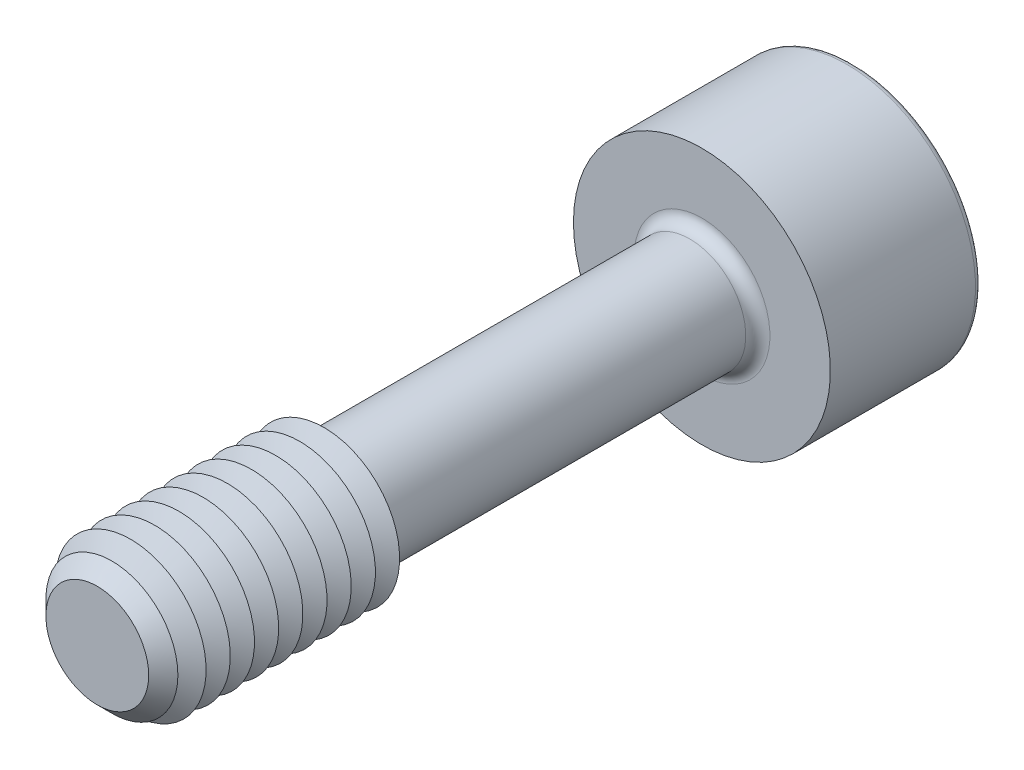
ISO-10303-21;
HEADER;
FILE_DESCRIPTION(('STEP AP214'),'2;1');
FILE_NAME('part.step','',(''),(''),'','','');
FILE_SCHEMA(('AUTOMOTIVE_DESIGN { 1 0 10303 214 1 1 1 1 }'));
ENDSEC;
DATA;
#1=APPLICATION_CONTEXT('core data for automotive mechanical design processes');
#2=APPLICATION_PROTOCOL_DEFINITION('international standard','automotive_design',2000,#1);
#3=PRODUCT_CONTEXT('',#1,'mechanical');
#4=PRODUCT('Part','Part','',(#3));
#5=PRODUCT_RELATED_PRODUCT_CATEGORY('part','',(#4));
#6=PRODUCT_DEFINITION_FORMATION('','',#4);
#7=PRODUCT_DEFINITION_CONTEXT('part definition',#1,'design');
#8=PRODUCT_DEFINITION('design','',#6,#7);
#9=PRODUCT_DEFINITION_SHAPE('','',#8);
#10=(LENGTH_UNIT() NAMED_UNIT(*) SI_UNIT(.MILLI.,.METRE.));
#11=(NAMED_UNIT(*) PLANE_ANGLE_UNIT() SI_UNIT($,.RADIAN.));
#12=(NAMED_UNIT(*) SI_UNIT($,.STERADIAN.) SOLID_ANGLE_UNIT());
#13=UNCERTAINTY_MEASURE_WITH_UNIT(LENGTH_MEASURE(1.E-05),#10,'distance_accuracy_value','');
#14=(GEOMETRIC_REPRESENTATION_CONTEXT(3) GLOBAL_UNCERTAINTY_ASSIGNED_CONTEXT((#13)) GLOBAL_UNIT_ASSIGNED_CONTEXT((#10,
#11,#12)) REPRESENTATION_CONTEXT('',''));
#15=CARTESIAN_POINT('',(0.,0.,0.));
#16=DIRECTION('',(0.,0.,1.));
#17=DIRECTION('',(1.,0.,0.));
#18=AXIS2_PLACEMENT_3D('',#15,#16,#17);
#19=CARTESIAN_POINT('',(-1.15470053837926,-2.,-11.));
#20=DIRECTION('',(0.,0.,1.));
#21=DIRECTION('',(1.,0.,0.));
#22=AXIS2_PLACEMENT_3D('',#19,#20,#21);
#23=PLANE('',#22);
#24=DIRECTION('',(1.,0.,0.));
#25=VECTOR('',#24,1.);
#26=CARTESIAN_POINT('',(-1.15470053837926,-2.,-11.));
#27=LINE('',#26,#25);
#28=CARTESIAN_POINT('',(0.,-2.,-11.));
#29=VERTEX_POINT('',#28);
#30=CARTESIAN_POINT('',(1.15470053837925,-2.,-11.));
#31=VERTEX_POINT('',#30);
#32=EDGE_CURVE('E795',#29,#31,#27,.T.);
#33=ORIENTED_EDGE('',*,*,#32,.F.);
#34=CARTESIAN_POINT('',(0.,0.,-11.));
#35=DIRECTION('',(0.,0.,1.));
#36=DIRECTION('',(0.,-1.,0.));
#37=AXIS2_PLACEMENT_3D('',#34,#35,#36);
#38=CIRCLE('',#37,2.);
#39=CARTESIAN_POINT('',(1.73205080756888,-0.999999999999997,-11.));
#40=VERTEX_POINT('',#39);
#41=EDGE_CURVE('E52',#29,#40,#38,.T.);
#42=ORIENTED_EDGE('',*,*,#41,.T.);
#43=DIRECTION('',(0.5,0.866025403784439,0.));
#44=VECTOR('',#43,1.);
#45=CARTESIAN_POINT('',(1.15470053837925,-2.,-11.));
#46=LINE('',#45,#44);
#47=EDGE_CURVE('E780',#31,#40,#46,.T.);
#48=ORIENTED_EDGE('',*,*,#47,.F.);
#49=EDGE_LOOP('',(#33,#42,#48));
#50=FACE_BOUND('',#49,.T.);
#51=ADVANCED_FACE('F40',(#50),#23,.F.);
#52=CARTESIAN_POINT('',(2.3094010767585,0.,-11.));
#53=VERTEX_POINT('',#52);
#54=EDGE_CURVE('E791',#40,#53,#46,.T.);
#55=ORIENTED_EDGE('',*,*,#54,.F.);
#56=CARTESIAN_POINT('',(1.73205080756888,1.,-11.));
#57=VERTEX_POINT('',#56);
#58=EDGE_CURVE('E11',#40,#57,#38,.T.);
#59=ORIENTED_EDGE('',*,*,#58,.T.);
#60=DIRECTION('',(-0.499999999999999,0.866025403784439,0.));
#61=VECTOR('',#60,1.);
#62=CARTESIAN_POINT('',(2.3094010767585,0.,-11.));
#63=LINE('',#62,#61);
#64=EDGE_CURVE('E779',#53,#57,#63,.T.);
#65=ORIENTED_EDGE('',*,*,#64,.F.);
#66=EDGE_LOOP('',(#55,#59,#65));
#67=FACE_BOUND('',#66,.T.);
#68=ADVANCED_FACE('F132',(#67),#23,.F.);
#69=CARTESIAN_POINT('',(1.15470053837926,2.,-11.));
#70=VERTEX_POINT('',#69);
#71=EDGE_CURVE('E775',#57,#70,#63,.T.);
#72=ORIENTED_EDGE('',*,*,#71,.F.);
#73=CARTESIAN_POINT('',(0.,2.00000000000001,-11.));
#74=VERTEX_POINT('',#73);
#75=EDGE_CURVE('E50',#57,#74,#38,.T.);
#76=ORIENTED_EDGE('',*,*,#75,.T.);
#77=DIRECTION('',(-1.,0.,0.));
#78=VECTOR('',#77,1.);
#79=CARTESIAN_POINT('',(1.15470053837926,2.,-11.));
#80=LINE('',#79,#78);
#81=EDGE_CURVE('E176',#70,#74,#80,.T.);
#82=ORIENTED_EDGE('',*,*,#81,.F.);
#83=EDGE_LOOP('',(#72,#76,#82));
#84=FACE_BOUND('',#83,.T.);
#85=ADVANCED_FACE('F138',(#84),#23,.F.);
#86=CARTESIAN_POINT('',(-1.15470053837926,2.,-11.));
#87=VERTEX_POINT('',#86);
#88=EDGE_CURVE('E785',#74,#87,#80,.T.);
#89=ORIENTED_EDGE('',*,*,#88,.F.);
#90=CARTESIAN_POINT('',(-1.73205080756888,1.00000000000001,-11.));
#91=VERTEX_POINT('',#90);
#92=EDGE_CURVE('E262',#74,#91,#38,.T.);
#93=ORIENTED_EDGE('',*,*,#92,.T.);
#94=DIRECTION('',(-0.5,-0.866025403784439,0.));
#95=VECTOR('',#94,1.);
#96=CARTESIAN_POINT('',(-1.15470053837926,2.,-11.));
#97=LINE('',#96,#95);
#98=EDGE_CURVE('E175',#87,#91,#97,.T.);
#99=ORIENTED_EDGE('',*,*,#98,.F.);
#100=EDGE_LOOP('',(#89,#93,#99));
#101=FACE_BOUND('',#100,.T.);
#102=ADVANCED_FACE('F156',(#101),#23,.F.);
#103=CARTESIAN_POINT('',(-2.30940107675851,0.,-11.));
#104=VERTEX_POINT('',#103);
#105=EDGE_CURVE('E169',#91,#104,#97,.T.);
#106=ORIENTED_EDGE('',*,*,#105,.F.);
#107=CARTESIAN_POINT('',(-1.73205080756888,-0.999999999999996,-11.));
#108=VERTEX_POINT('',#107);
#109=EDGE_CURVE('E171',#91,#108,#38,.T.);
#110=ORIENTED_EDGE('',*,*,#109,.T.);
#111=DIRECTION('',(0.5,-0.866025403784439,0.));
#112=VECTOR('',#111,1.);
#113=CARTESIAN_POINT('',(-2.30940107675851,0.,-11.));
#114=LINE('',#113,#112);
#115=EDGE_CURVE('E173',#104,#108,#114,.T.);
#116=ORIENTED_EDGE('',*,*,#115,.F.);
#117=EDGE_LOOP('',(#106,#110,#116));
#118=FACE_BOUND('',#117,.T.);
#119=ADVANCED_FACE('F145',(#118),#23,.F.);
#120=CARTESIAN_POINT('',(0.,0.,-15.));
#121=DIRECTION('',(0.,0.,-1.));
#122=DIRECTION('',(-1.,0.,0.));
#123=AXIS2_PLACEMENT_3D('',#120,#121,#122);
#124=PLANE('',#123);
#125=CARTESIAN_POINT('',(0.,0.,-15.));
#126=DIRECTION('',(0.,0.,-1.));
#127=DIRECTION('',(-1.,0.,0.));
#128=AXIS2_PLACEMENT_3D('',#125,#126,#127);
#129=CIRCLE('',#128,4.05);
#130=CARTESIAN_POINT('',(-4.05,0.,-15.));
#131=VERTEX_POINT('',#130);
#132=EDGE_CURVE('E249',#131,#131,#129,.T.);
#133=ORIENTED_EDGE('',*,*,#132,.T.);
#134=EDGE_LOOP('',(#133));
#135=FACE_BOUND('',#134,.T.);
#136=DIRECTION('',(-0.5,-0.866025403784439,0.));
#137=VECTOR('',#136,1.);
#138=CARTESIAN_POINT('',(-1.15470053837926,2.,-15.));
#139=LINE('',#138,#137);
#140=CARTESIAN_POINT('',(-1.15470053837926,2.,-15.));
#141=VERTEX_POINT('',#140);
#142=CARTESIAN_POINT('',(-2.30940107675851,0.,-15.));
#143=VERTEX_POINT('',#142);
#144=EDGE_CURVE('E210',#141,#143,#139,.T.);
#145=ORIENTED_EDGE('',*,*,#144,.T.);
#146=DIRECTION('',(0.5,-0.866025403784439,0.));
#147=VECTOR('',#146,1.);
#148=CARTESIAN_POINT('',(-2.30940107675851,0.,-15.));
#149=LINE('',#148,#147);
#150=CARTESIAN_POINT('',(-1.15470053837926,-2.,-15.));
#151=VERTEX_POINT('',#150);
#152=EDGE_CURVE('E66',#143,#151,#149,.T.);
#153=ORIENTED_EDGE('',*,*,#152,.T.);
#154=DIRECTION('',(1.,0.,0.));
#155=VECTOR('',#154,1.);
#156=CARTESIAN_POINT('',(-1.15470053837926,-2.,-15.));
#157=LINE('',#156,#155);
#158=CARTESIAN_POINT('',(1.15470053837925,-2.,-15.));
#159=VERTEX_POINT('',#158);
#160=EDGE_CURVE('E195',#151,#159,#157,.T.);
#161=ORIENTED_EDGE('',*,*,#160,.T.);
#162=DIRECTION('',(0.5,0.866025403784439,0.));
#163=VECTOR('',#162,1.);
#164=CARTESIAN_POINT('',(1.15470053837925,-2.,-15.));
#165=LINE('',#164,#163);
#166=CARTESIAN_POINT('',(2.3094010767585,0.,-15.));
#167=VERTEX_POINT('',#166);
#168=EDGE_CURVE('E199',#159,#167,#165,.T.);
#169=ORIENTED_EDGE('',*,*,#168,.T.);
#170=DIRECTION('',(-0.499999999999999,0.866025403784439,0.));
#171=VECTOR('',#170,1.);
#172=CARTESIAN_POINT('',(2.3094010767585,0.,-15.));
#173=LINE('',#172,#171);
#174=CARTESIAN_POINT('',(1.15470053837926,2.,-15.));
#175=VERTEX_POINT('',#174);
#176=EDGE_CURVE('E203',#167,#175,#173,.T.);
#177=ORIENTED_EDGE('',*,*,#176,.T.);
#178=DIRECTION('',(-1.,0.,0.));
#179=VECTOR('',#178,1.);
#180=CARTESIAN_POINT('',(1.15470053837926,2.,-15.));
#181=LINE('',#180,#179);
#182=EDGE_CURVE('E207',#175,#141,#181,.T.);
#183=ORIENTED_EDGE('',*,*,#182,.T.);
#184=EDGE_LOOP('',(#145,#153,#161,#169,#177,#183));
#185=FACE_BOUND('',#184,.T.);
#186=ADVANCED_FACE('F155',(#135,#185),#124,.T.);
#187=CARTESIAN_POINT('',(0.,0.,10.));
#188=DIRECTION('',(0.,0.,-1.));
#189=DIRECTION('',(-1.,0.,0.));
#190=AXIS2_PLACEMENT_3D('',#187,#188,#189);
#191=CYLINDRICAL_SURFACE('',#190,1.85);
#192=CARTESIAN_POINT('',(0.,0.,-9.6));
#193=DIRECTION('',(0.,0.,-1.));
#194=DIRECTION('',(-1.,0.,0.));
#195=AXIS2_PLACEMENT_3D('',#192,#193,#194);
#196=CIRCLE('',#195,1.85);
#197=CARTESIAN_POINT('',(-1.85,0.,-9.6));
#198=VERTEX_POINT('',#197);
#199=EDGE_CURVE('E245',#198,#198,#196,.F.);
#200=ORIENTED_EDGE('',*,*,#199,.T.);
#201=EDGE_LOOP('',(#200));
#202=FACE_BOUND('',#201,.T.);
#203=CARTESIAN_POINT('',(0.,0.,2.12472232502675));
#204=DIRECTION('',(0.,0.,-1.));
#205=DIRECTION('',(0.,1.,0.));
#206=AXIS2_PLACEMENT_3D('',#203,#204,#205);
#207=CIRCLE('',#206,1.85);
#208=CARTESIAN_POINT('',(0.,1.85,2.12472232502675));
#209=VERTEX_POINT('',#208);
#210=EDGE_CURVE('E233',#209,#209,#207,.T.);
#211=ORIENTED_EDGE('',*,*,#210,.T.);
#212=EDGE_LOOP('',(#211));
#213=FACE_BOUND('',#212,.T.);
#214=ADVANCED_FACE('F162',(#202,#213),#191,.T.);
#215=CARTESIAN_POINT('',(0.,0.,2.12472232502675));
#216=DIRECTION('',(0.,0.,1.));
#217=DIRECTION('',(0.,-1.,0.));
#218=AXIS2_PLACEMENT_3D('',#215,#216,#217);
#219=CONICAL_SURFACE('',#218,1.85,1.0471975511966);
#220=CARTESIAN_POINT('',(0.,0.,2.5));
#221=DIRECTION('',(0.,0.,-1.));
#222=DIRECTION('',(-1.,0.,0.));
#223=AXIS2_PLACEMENT_3D('',#220,#221,#222);
#224=CIRCLE('',#223,2.5);
#225=CARTESIAN_POINT('',(-2.5,0.,2.5));
#226=VERTEX_POINT('',#225);
#227=EDGE_CURVE('E266',#226,#226,#224,.T.);
#228=ORIENTED_EDGE('',*,*,#227,.T.);
#229=EDGE_LOOP('',(#228));
#230=FACE_BOUND('',#229,.T.);
#231=ORIENTED_EDGE('',*,*,#210,.F.);
#232=EDGE_LOOP('',(#231));
#233=FACE_BOUND('',#232,.T.);
#234=ADVANCED_FACE('F536',(#230,#233),#219,.T.);
#235=CARTESIAN_POINT('',(0.,0.,-10.));
#236=DIRECTION('',(0.,0.,-1.));
#237=DIRECTION('',(-1.,0.,0.));
#238=AXIS2_PLACEMENT_3D('',#235,#236,#237);
#239=PLANE('',#238);
#240=CARTESIAN_POINT('',(0.,0.,-10.));
#241=DIRECTION('',(0.,0.,-1.));
#242=DIRECTION('',(-1.,0.,0.));
#243=AXIS2_PLACEMENT_3D('',#240,#241,#242);
#244=CIRCLE('',#243,2.25);
#245=CARTESIAN_POINT('',(-2.25,0.,-10.));
#246=VERTEX_POINT('',#245);
#247=EDGE_CURVE('E241',#246,#246,#244,.T.);
#248=ORIENTED_EDGE('',*,*,#247,.T.);
#249=EDGE_LOOP('',(#248));
#250=FACE_BOUND('',#249,.T.);
#251=CARTESIAN_POINT('',(0.,0.,-10.));
#252=DIRECTION('',(0.,0.,-1.));
#253=DIRECTION('',(-1.,0.,0.));
#254=AXIS2_PLACEMENT_3D('',#251,#252,#253);
#255=CIRCLE('',#254,4.25);
#256=CARTESIAN_POINT('',(-4.25,0.,-10.));
#257=VERTEX_POINT('',#256);
#258=EDGE_CURVE('E229',#257,#257,#255,.T.);
#259=ORIENTED_EDGE('',*,*,#258,.F.);
#260=EDGE_LOOP('',(#259));
#261=FACE_BOUND('',#260,.T.);
#262=ADVANCED_FACE('F529',(#250,#261),#239,.F.);
#263=CARTESIAN_POINT('',(0.,0.,-15.));
#264=DIRECTION('',(0.,0.,1.));
#265=DIRECTION('',(1.,0.,0.));
#266=AXIS2_PLACEMENT_3D('',#263,#264,#265);
#267=CYLINDRICAL_SURFACE('',#266,4.25);
#268=CARTESIAN_POINT('',(0.,0.,-14.8));
#269=DIRECTION('',(0.,0.,-1.));
#270=DIRECTION('',(-1.,0.,0.));
#271=AXIS2_PLACEMENT_3D('',#268,#269,#270);
#272=CIRCLE('',#271,4.25);
#273=CARTESIAN_POINT('',(-4.25,0.,-14.8));
#274=VERTEX_POINT('',#273);
#275=EDGE_CURVE('E252',#274,#274,#272,.F.);
#276=ORIENTED_EDGE('',*,*,#275,.T.);
#277=EDGE_LOOP('',(#276));
#278=FACE_BOUND('',#277,.T.);
#279=ORIENTED_EDGE('',*,*,#258,.T.);
#280=EDGE_LOOP('',(#279));
#281=FACE_BOUND('',#280,.T.);
#282=ADVANCED_FACE('F535',(#278,#281),#267,.T.);
#283=CARTESIAN_POINT('',(-2.30940107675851,0.,-11.));
#284=DIRECTION('',(0.866025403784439,0.5,0.));
#285=DIRECTION('',(-0.5,0.866025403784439,0.));
#286=AXIS2_PLACEMENT_3D('',#283,#284,#285);
#287=PLANE('',#286);
#288=ORIENTED_EDGE('',*,*,#152,.F.);
#289=DIRECTION('',(0.,0.,-1.));
#290=VECTOR('',#289,1.);
#291=CARTESIAN_POINT('',(-2.30940107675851,0.,-11.));
#292=LINE('',#291,#290);
#293=EDGE_CURVE('E185',#104,#143,#292,.T.);
#294=ORIENTED_EDGE('',*,*,#293,.F.);
#295=ORIENTED_EDGE('',*,*,#115,.T.);
#296=CARTESIAN_POINT('',(-1.15470053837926,-2.,-11.));
#297=VERTEX_POINT('',#296);
#298=EDGE_CURVE('E213',#108,#297,#114,.T.);
#299=ORIENTED_EDGE('',*,*,#298,.T.);
#300=DIRECTION('',(0.,0.,-1.));
#301=VECTOR('',#300,1.);
#302=CARTESIAN_POINT('',(-1.15470053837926,-2.,-11.));
#303=LINE('',#302,#301);
#304=EDGE_CURVE('E226',#297,#151,#303,.T.);
#305=ORIENTED_EDGE('',*,*,#304,.T.);
#306=EDGE_LOOP('',(#288,#294,#295,#299,#305));
#307=FACE_BOUND('',#306,.T.);
#308=ADVANCED_FACE('F547',(#307),#287,.T.);
#309=CARTESIAN_POINT('',(-1.15470053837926,-2.,-11.));
#310=DIRECTION('',(0.,1.,0.));
#311=DIRECTION('',(-1.,0.,0.));
#312=AXIS2_PLACEMENT_3D('',#309,#310,#311);
#313=PLANE('',#312);
#314=ORIENTED_EDGE('',*,*,#160,.F.);
#315=ORIENTED_EDGE('',*,*,#304,.F.);
#316=EDGE_CURVE('E792',#297,#29,#27,.T.);
#317=ORIENTED_EDGE('',*,*,#316,.T.);
#318=ORIENTED_EDGE('',*,*,#32,.T.);
#319=DIRECTION('',(0.,0.,-1.));
#320=VECTOR('',#319,1.);
#321=CARTESIAN_POINT('',(1.15470053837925,-2.,-11.));
#322=LINE('',#321,#320);
#323=EDGE_CURVE('E223',#31,#159,#322,.T.);
#324=ORIENTED_EDGE('',*,*,#323,.T.);
#325=EDGE_LOOP('',(#314,#315,#317,#318,#324));
#326=FACE_BOUND('',#325,.T.);
#327=ADVANCED_FACE('F563',(#326),#313,.T.);
#328=CARTESIAN_POINT('',(1.15470053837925,-2.,-11.));
#329=DIRECTION('',(-0.866025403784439,0.5,0.));
#330=DIRECTION('',(-0.5,-0.866025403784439,0.));
#331=AXIS2_PLACEMENT_3D('',#328,#329,#330);
#332=PLANE('',#331);
#333=ORIENTED_EDGE('',*,*,#168,.F.);
#334=ORIENTED_EDGE('',*,*,#323,.F.);
#335=ORIENTED_EDGE('',*,*,#47,.T.);
#336=ORIENTED_EDGE('',*,*,#54,.T.);
#337=DIRECTION('',(0.,0.,-1.));
#338=VECTOR('',#337,1.);
#339=CARTESIAN_POINT('',(2.3094010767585,0.,-11.));
#340=LINE('',#339,#338);
#341=EDGE_CURVE('E220',#53,#167,#340,.T.);
#342=ORIENTED_EDGE('',*,*,#341,.T.);
#343=EDGE_LOOP('',(#333,#334,#335,#336,#342));
#344=FACE_BOUND('',#343,.T.);
#345=ADVANCED_FACE('F573',(#344),#332,.T.);
#346=CARTESIAN_POINT('',(2.3094010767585,0.,-11.));
#347=DIRECTION('',(-0.866025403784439,-0.499999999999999,0.));
#348=DIRECTION('',(0.499999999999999,-0.866025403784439,0.));
#349=AXIS2_PLACEMENT_3D('',#346,#347,#348);
#350=PLANE('',#349);
#351=ORIENTED_EDGE('',*,*,#176,.F.);
#352=ORIENTED_EDGE('',*,*,#341,.F.);
#353=ORIENTED_EDGE('',*,*,#64,.T.);
#354=ORIENTED_EDGE('',*,*,#71,.T.);
#355=DIRECTION('',(0.,0.,-1.));
#356=VECTOR('',#355,1.);
#357=CARTESIAN_POINT('',(1.15470053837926,2.,-11.));
#358=LINE('',#357,#356);
#359=EDGE_CURVE('E217',#70,#175,#358,.T.);
#360=ORIENTED_EDGE('',*,*,#359,.T.);
#361=EDGE_LOOP('',(#351,#352,#353,#354,#360));
#362=FACE_BOUND('',#361,.T.);
#363=ADVANCED_FACE('F583',(#362),#350,.T.);
#364=CARTESIAN_POINT('',(1.15470053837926,2.,-11.));
#365=DIRECTION('',(0.,-1.,0.));
#366=DIRECTION('',(0.,0.,-1.));
#367=AXIS2_PLACEMENT_3D('',#364,#365,#366);
#368=PLANE('',#367);
#369=ORIENTED_EDGE('',*,*,#182,.F.);
#370=ORIENTED_EDGE('',*,*,#359,.F.);
#371=ORIENTED_EDGE('',*,*,#81,.T.);
#372=ORIENTED_EDGE('',*,*,#88,.T.);
#373=DIRECTION('',(0.,0.,-1.));
#374=VECTOR('',#373,1.);
#375=CARTESIAN_POINT('',(-1.15470053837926,2.,-11.));
#376=LINE('',#375,#374);
#377=EDGE_CURVE('E181',#87,#141,#376,.T.);
#378=ORIENTED_EDGE('',*,*,#377,.T.);
#379=EDGE_LOOP('',(#369,#370,#371,#372,#378));
#380=FACE_BOUND('',#379,.T.);
#381=ADVANCED_FACE('F151',(#380),#368,.T.);
#382=CARTESIAN_POINT('',(-1.15470053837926,2.,-11.));
#383=DIRECTION('',(0.866025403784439,-0.5,0.));
#384=DIRECTION('',(0.5,0.866025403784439,0.));
#385=AXIS2_PLACEMENT_3D('',#382,#383,#384);
#386=PLANE('',#385);
#387=ORIENTED_EDGE('',*,*,#144,.F.);
#388=ORIENTED_EDGE('',*,*,#377,.F.);
#389=ORIENTED_EDGE('',*,*,#98,.T.);
#390=ORIENTED_EDGE('',*,*,#105,.T.);
#391=ORIENTED_EDGE('',*,*,#293,.T.);
#392=EDGE_LOOP('',(#387,#388,#389,#390,#391));
#393=FACE_BOUND('',#392,.T.);
#394=ADVANCED_FACE('F143',(#393),#386,.T.);
#395=ORIENTED_EDGE('',*,*,#298,.F.);
#396=EDGE_CURVE('E255',#108,#29,#38,.T.);
#397=ORIENTED_EDGE('',*,*,#396,.T.);
#398=ORIENTED_EDGE('',*,*,#316,.F.);
#399=EDGE_LOOP('',(#395,#397,#398));
#400=FACE_BOUND('',#399,.T.);
#401=ADVANCED_FACE('F134',(#400),#23,.F.);
#402=CARTESIAN_POINT('',(0.,0.,-9.6));
#403=DIRECTION('',(0.,0.,-1.));
#404=DIRECTION('',(-1.,0.,0.));
#405=AXIS2_PLACEMENT_3D('',#402,#403,#404);
#406=TOROIDAL_SURFACE('',#405,2.25,0.4);
#407=ORIENTED_EDGE('',*,*,#199,.F.);
#408=EDGE_LOOP('',(#407));
#409=FACE_BOUND('',#408,.T.);
#410=ORIENTED_EDGE('',*,*,#247,.F.);
#411=EDGE_LOOP('',(#410));
#412=FACE_BOUND('',#411,.T.);
#413=ADVANCED_FACE('F128',(#409,#412),#406,.F.);
#414=CARTESIAN_POINT('',(0.,0.,-14.8));
#415=DIRECTION('',(0.,0.,-1.));
#416=DIRECTION('',(-1.,0.,0.));
#417=AXIS2_PLACEMENT_3D('',#414,#415,#416);
#418=TOROIDAL_SURFACE('',#417,4.05,0.2);
#419=ORIENTED_EDGE('',*,*,#275,.F.);
#420=EDGE_LOOP('',(#419));
#421=FACE_BOUND('',#420,.T.);
#422=ORIENTED_EDGE('',*,*,#132,.F.);
#423=EDGE_LOOP('',(#422));
#424=FACE_BOUND('',#423,.T.);
#425=ADVANCED_FACE('F42',(#421,#424),#418,.T.);
#426=CARTESIAN_POINT('',(0.,0.,-9.84529946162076));
#427=DIRECTION('',(0.,0.,-1.));
#428=DIRECTION('',(0.,1.,0.));
#429=AXIS2_PLACEMENT_3D('',#426,#427,#428);
#430=CONICAL_SURFACE('',#429,0.,1.04719755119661);
#431=ORIENTED_EDGE('',*,*,#41,.F.);
#432=ORIENTED_EDGE('',*,*,#396,.F.);
#433=ORIENTED_EDGE('',*,*,#109,.F.);
#434=ORIENTED_EDGE('',*,*,#92,.F.);
#435=ORIENTED_EDGE('',*,*,#75,.F.);
#436=ORIENTED_EDGE('',*,*,#58,.F.);
#437=EDGE_LOOP('',(#431,#432,#433,#434,#435,#436));
#438=FACE_BOUND('',#437,.T.);
#439=CARTESIAN_POINT('',(0.,0.,-9.84529946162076));
#440=VERTEX_POINT('',#439);
#441=VERTEX_LOOP('',#440);
#442=FACE_BOUND('',#441,.T.);
#443=ADVANCED_FACE('F117',(#438,#442),#430,.F.);
#444=CARTESIAN_POINT('',(0.,0.,2.9));
#445=DIRECTION('',(0.,0.,-1.));
#446=DIRECTION('',(-1.,0.,0.));
#447=AXIS2_PLACEMENT_3D('',#444,#445,#446);
#448=CONICAL_SURFACE('',#447,1.80717967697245,1.0471975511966);
#449=ORIENTED_EDGE('',*,*,#227,.F.);
#450=EDGE_LOOP('',(#449));
#451=FACE_BOUND('',#450,.T.);
#452=CARTESIAN_POINT('',(0.,0.,2.9));
#453=DIRECTION('',(0.,0.,-1.));
#454=DIRECTION('',(-1.,0.,0.));
#455=AXIS2_PLACEMENT_3D('',#452,#453,#454);
#456=CIRCLE('',#455,1.80717967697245);
#457=CARTESIAN_POINT('',(-1.80717967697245,0.,2.9));
#458=VERTEX_POINT('',#457);
#459=EDGE_CURVE('E273',#458,#458,#456,.T.);
#460=ORIENTED_EDGE('',*,*,#459,.T.);
#461=EDGE_LOOP('',(#460));
#462=FACE_BOUND('',#461,.T.);
#463=ADVANCED_FACE('F119',(#451,#462),#448,.T.);
#464=CARTESIAN_POINT('',(0.,0.,3.3));
#465=DIRECTION('',(0.,0.,1.));
#466=DIRECTION('',(1.,0.,0.));
#467=AXIS2_PLACEMENT_3D('',#464,#465,#466);
#468=CONICAL_SURFACE('',#467,2.5,1.0471975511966);
#469=ORIENTED_EDGE('',*,*,#459,.F.);
#470=EDGE_LOOP('',(#469));
#471=FACE_BOUND('',#470,.T.);
#472=CARTESIAN_POINT('',(0.,0.,3.3));
#473=DIRECTION('',(0.,0.,-1.));
#474=DIRECTION('',(-1.,0.,0.));
#475=AXIS2_PLACEMENT_3D('',#472,#473,#474);
#476=CIRCLE('',#475,2.5);
#477=CARTESIAN_POINT('',(-2.5,0.,3.3));
#478=VERTEX_POINT('',#477);
#479=EDGE_CURVE('E279',#478,#478,#476,.T.);
#480=ORIENTED_EDGE('',*,*,#479,.T.);
#481=EDGE_LOOP('',(#480));
#482=FACE_BOUND('',#481,.T.);
#483=ADVANCED_FACE('F125',(#471,#482),#468,.T.);
#484=CARTESIAN_POINT('',(0.,0.,3.7));
#485=DIRECTION('',(0.,0.,-1.));
#486=DIRECTION('',(-1.,0.,0.));
#487=AXIS2_PLACEMENT_3D('',#484,#485,#486);
#488=CONICAL_SURFACE('',#487,1.80717967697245,1.0471975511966);
#489=ORIENTED_EDGE('',*,*,#479,.F.);
#490=EDGE_LOOP('',(#489));
#491=FACE_BOUND('',#490,.T.);
#492=CARTESIAN_POINT('',(0.,0.,3.7));
#493=DIRECTION('',(0.,0.,-1.));
#494=DIRECTION('',(-1.,0.,0.));
#495=AXIS2_PLACEMENT_3D('',#492,#493,#494);
#496=CIRCLE('',#495,1.80717967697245);
#497=CARTESIAN_POINT('',(-1.80717967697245,0.,3.7));
#498=VERTEX_POINT('',#497);
#499=EDGE_CURVE('E285',#498,#498,#496,.T.);
#500=ORIENTED_EDGE('',*,*,#499,.T.);
#501=EDGE_LOOP('',(#500));
#502=FACE_BOUND('',#501,.T.);
#503=ADVANCED_FACE('F413',(#491,#502),#488,.T.);
#504=CARTESIAN_POINT('',(0.,0.,4.1));
#505=DIRECTION('',(0.,0.,1.));
#506=DIRECTION('',(1.,0.,0.));
#507=AXIS2_PLACEMENT_3D('',#504,#505,#506);
#508=CONICAL_SURFACE('',#507,2.5,1.0471975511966);
#509=ORIENTED_EDGE('',*,*,#499,.F.);
#510=EDGE_LOOP('',(#509));
#511=FACE_BOUND('',#510,.T.);
#512=CARTESIAN_POINT('',(0.,0.,4.1));
#513=DIRECTION('',(0.,0.,-1.));
#514=DIRECTION('',(-1.,0.,0.));
#515=AXIS2_PLACEMENT_3D('',#512,#513,#514);
#516=CIRCLE('',#515,2.5);
#517=CARTESIAN_POINT('',(-2.5,0.,4.1));
#518=VERTEX_POINT('',#517);
#519=EDGE_CURVE('E289',#518,#518,#516,.T.);
#520=ORIENTED_EDGE('',*,*,#519,.T.);
#521=EDGE_LOOP('',(#520));
#522=FACE_BOUND('',#521,.T.);
#523=ADVANCED_FACE('F409',(#511,#522),#508,.T.);
#524=CARTESIAN_POINT('',(0.,0.,4.5));
#525=DIRECTION('',(0.,0.,-1.));
#526=DIRECTION('',(-1.,0.,0.));
#527=AXIS2_PLACEMENT_3D('',#524,#525,#526);
#528=CONICAL_SURFACE('',#527,1.80717967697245,1.0471975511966);
#529=ORIENTED_EDGE('',*,*,#519,.F.);
#530=EDGE_LOOP('',(#529));
#531=FACE_BOUND('',#530,.T.);
#532=CARTESIAN_POINT('',(0.,0.,4.5));
#533=DIRECTION('',(0.,0.,-1.));
#534=DIRECTION('',(-1.,0.,0.));
#535=AXIS2_PLACEMENT_3D('',#532,#533,#534);
#536=CIRCLE('',#535,1.80717967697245);
#537=CARTESIAN_POINT('',(-1.80717967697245,0.,4.5));
#538=VERTEX_POINT('',#537);
#539=EDGE_CURVE('E293',#538,#538,#536,.T.);
#540=ORIENTED_EDGE('',*,*,#539,.T.);
#541=EDGE_LOOP('',(#540));
#542=FACE_BOUND('',#541,.T.);
#543=ADVANCED_FACE('F405',(#531,#542),#528,.T.);
#544=CARTESIAN_POINT('',(0.,0.,4.9));
#545=DIRECTION('',(0.,0.,1.));
#546=DIRECTION('',(1.,0.,0.));
#547=AXIS2_PLACEMENT_3D('',#544,#545,#546);
#548=CONICAL_SURFACE('',#547,2.5,1.0471975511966);
#549=ORIENTED_EDGE('',*,*,#539,.F.);
#550=EDGE_LOOP('',(#549));
#551=FACE_BOUND('',#550,.T.);
#552=CARTESIAN_POINT('',(0.,0.,4.9));
#553=DIRECTION('',(0.,0.,-1.));
#554=DIRECTION('',(-1.,0.,0.));
#555=AXIS2_PLACEMENT_3D('',#552,#553,#554);
#556=CIRCLE('',#555,2.5);
#557=CARTESIAN_POINT('',(-2.5,0.,4.9));
#558=VERTEX_POINT('',#557);
#559=EDGE_CURVE('E297',#558,#558,#556,.T.);
#560=ORIENTED_EDGE('',*,*,#559,.T.);
#561=EDGE_LOOP('',(#560));
#562=FACE_BOUND('',#561,.T.);
#563=ADVANCED_FACE('F401',(#551,#562),#548,.T.);
#564=CARTESIAN_POINT('',(0.,0.,5.3));
#565=DIRECTION('',(0.,0.,-1.));
#566=DIRECTION('',(-1.,0.,0.));
#567=AXIS2_PLACEMENT_3D('',#564,#565,#566);
#568=CONICAL_SURFACE('',#567,1.80717967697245,1.0471975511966);
#569=ORIENTED_EDGE('',*,*,#559,.F.);
#570=EDGE_LOOP('',(#569));
#571=FACE_BOUND('',#570,.T.);
#572=CARTESIAN_POINT('',(0.,0.,5.3));
#573=DIRECTION('',(0.,0.,-1.));
#574=DIRECTION('',(-1.,0.,0.));
#575=AXIS2_PLACEMENT_3D('',#572,#573,#574);
#576=CIRCLE('',#575,1.80717967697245);
#577=CARTESIAN_POINT('',(-1.80717967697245,0.,5.3));
#578=VERTEX_POINT('',#577);
#579=EDGE_CURVE('E301',#578,#578,#576,.T.);
#580=ORIENTED_EDGE('',*,*,#579,.T.);
#581=EDGE_LOOP('',(#580));
#582=FACE_BOUND('',#581,.T.);
#583=ADVANCED_FACE('F397',(#571,#582),#568,.T.);
#584=CARTESIAN_POINT('',(0.,0.,5.7));
#585=DIRECTION('',(0.,0.,1.));
#586=DIRECTION('',(1.,0.,0.));
#587=AXIS2_PLACEMENT_3D('',#584,#585,#586);
#588=CONICAL_SURFACE('',#587,2.5,1.0471975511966);
#589=ORIENTED_EDGE('',*,*,#579,.F.);
#590=EDGE_LOOP('',(#589));
#591=FACE_BOUND('',#590,.T.);
#592=CARTESIAN_POINT('',(0.,0.,5.7));
#593=DIRECTION('',(0.,0.,-1.));
#594=DIRECTION('',(-1.,0.,0.));
#595=AXIS2_PLACEMENT_3D('',#592,#593,#594);
#596=CIRCLE('',#595,2.5);
#597=CARTESIAN_POINT('',(-2.5,0.,5.7));
#598=VERTEX_POINT('',#597);
#599=EDGE_CURVE('E305',#598,#598,#596,.T.);
#600=ORIENTED_EDGE('',*,*,#599,.T.);
#601=EDGE_LOOP('',(#600));
#602=FACE_BOUND('',#601,.T.);
#603=ADVANCED_FACE('F393',(#591,#602),#588,.T.);
#604=CARTESIAN_POINT('',(0.,0.,6.1));
#605=DIRECTION('',(0.,0.,-1.));
#606=DIRECTION('',(-1.,0.,0.));
#607=AXIS2_PLACEMENT_3D('',#604,#605,#606);
#608=CONICAL_SURFACE('',#607,1.80717967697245,1.0471975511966);
#609=ORIENTED_EDGE('',*,*,#599,.F.);
#610=EDGE_LOOP('',(#609));
#611=FACE_BOUND('',#610,.T.);
#612=CARTESIAN_POINT('',(0.,0.,6.1));
#613=DIRECTION('',(0.,0.,-1.));
#614=DIRECTION('',(-1.,0.,0.));
#615=AXIS2_PLACEMENT_3D('',#612,#613,#614);
#616=CIRCLE('',#615,1.80717967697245);
#617=CARTESIAN_POINT('',(-1.80717967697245,0.,6.1));
#618=VERTEX_POINT('',#617);
#619=EDGE_CURVE('E309',#618,#618,#616,.T.);
#620=ORIENTED_EDGE('',*,*,#619,.T.);
#621=EDGE_LOOP('',(#620));
#622=FACE_BOUND('',#621,.T.);
#623=ADVANCED_FACE('F389',(#611,#622),#608,.T.);
#624=CARTESIAN_POINT('',(0.,0.,6.5));
#625=DIRECTION('',(0.,0.,1.));
#626=DIRECTION('',(1.,0.,0.));
#627=AXIS2_PLACEMENT_3D('',#624,#625,#626);
#628=CONICAL_SURFACE('',#627,2.5,1.0471975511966);
#629=ORIENTED_EDGE('',*,*,#619,.F.);
#630=EDGE_LOOP('',(#629));
#631=FACE_BOUND('',#630,.T.);
#632=CARTESIAN_POINT('',(0.,0.,6.5));
#633=DIRECTION('',(0.,0.,-1.));
#634=DIRECTION('',(-1.,0.,0.));
#635=AXIS2_PLACEMENT_3D('',#632,#633,#634);
#636=CIRCLE('',#635,2.5);
#637=CARTESIAN_POINT('',(-2.5,0.,6.5));
#638=VERTEX_POINT('',#637);
#639=EDGE_CURVE('E312',#638,#638,#636,.T.);
#640=ORIENTED_EDGE('',*,*,#639,.T.);
#641=EDGE_LOOP('',(#640));
#642=FACE_BOUND('',#641,.T.);
#643=ADVANCED_FACE('F385',(#631,#642),#628,.T.);
#644=CARTESIAN_POINT('',(0.,0.,6.9));
#645=DIRECTION('',(0.,0.,-1.));
#646=DIRECTION('',(-1.,0.,0.));
#647=AXIS2_PLACEMENT_3D('',#644,#645,#646);
#648=CONICAL_SURFACE('',#647,1.80717967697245,1.0471975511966);
#649=ORIENTED_EDGE('',*,*,#639,.F.);
#650=EDGE_LOOP('',(#649));
#651=FACE_BOUND('',#650,.T.);
#652=CARTESIAN_POINT('',(0.,0.,6.9));
#653=DIRECTION('',(0.,0.,-1.));
#654=DIRECTION('',(-1.,0.,0.));
#655=AXIS2_PLACEMENT_3D('',#652,#653,#654);
#656=CIRCLE('',#655,1.80717967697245);
#657=CARTESIAN_POINT('',(-1.80717967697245,0.,6.9));
#658=VERTEX_POINT('',#657);
#659=EDGE_CURVE('E315',#658,#658,#656,.T.);
#660=ORIENTED_EDGE('',*,*,#659,.T.);
#661=EDGE_LOOP('',(#660));
#662=FACE_BOUND('',#661,.T.);
#663=ADVANCED_FACE('F381',(#651,#662),#648,.T.);
#664=CARTESIAN_POINT('',(0.,0.,7.3));
#665=DIRECTION('',(0.,0.,1.));
#666=DIRECTION('',(1.,0.,0.));
#667=AXIS2_PLACEMENT_3D('',#664,#665,#666);
#668=CONICAL_SURFACE('',#667,2.5,1.0471975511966);
#669=ORIENTED_EDGE('',*,*,#659,.F.);
#670=EDGE_LOOP('',(#669));
#671=FACE_BOUND('',#670,.T.);
#672=CARTESIAN_POINT('',(0.,0.,7.3));
#673=DIRECTION('',(0.,0.,-1.));
#674=DIRECTION('',(-1.,0.,0.));
#675=AXIS2_PLACEMENT_3D('',#672,#673,#674);
#676=CIRCLE('',#675,2.5);
#677=CARTESIAN_POINT('',(-2.5,0.,7.3));
#678=VERTEX_POINT('',#677);
#679=EDGE_CURVE('E319',#678,#678,#676,.T.);
#680=ORIENTED_EDGE('',*,*,#679,.T.);
#681=EDGE_LOOP('',(#680));
#682=FACE_BOUND('',#681,.T.);
#683=ADVANCED_FACE('F377',(#671,#682),#668,.T.);
#684=CARTESIAN_POINT('',(0.,0.,7.7));
#685=DIRECTION('',(0.,0.,-1.));
#686=DIRECTION('',(-1.,0.,0.));
#687=AXIS2_PLACEMENT_3D('',#684,#685,#686);
#688=CONICAL_SURFACE('',#687,1.80717967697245,1.0471975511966);
#689=ORIENTED_EDGE('',*,*,#679,.F.);
#690=EDGE_LOOP('',(#689));
#691=FACE_BOUND('',#690,.T.);
#692=CARTESIAN_POINT('',(0.,0.,7.7));
#693=DIRECTION('',(0.,0.,-1.));
#694=DIRECTION('',(-1.,0.,0.));
#695=AXIS2_PLACEMENT_3D('',#692,#693,#694);
#696=CIRCLE('',#695,1.80717967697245);
#697=CARTESIAN_POINT('',(-1.80717967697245,0.,7.7));
#698=VERTEX_POINT('',#697);
#699=EDGE_CURVE('E323',#698,#698,#696,.T.);
#700=ORIENTED_EDGE('',*,*,#699,.T.);
#701=EDGE_LOOP('',(#700));
#702=FACE_BOUND('',#701,.T.);
#703=ADVANCED_FACE('F373',(#691,#702),#688,.T.);
#704=CARTESIAN_POINT('',(0.,0.,8.1));
#705=DIRECTION('',(0.,0.,1.));
#706=DIRECTION('',(1.,0.,0.));
#707=AXIS2_PLACEMENT_3D('',#704,#705,#706);
#708=CONICAL_SURFACE('',#707,2.5,1.0471975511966);
#709=ORIENTED_EDGE('',*,*,#699,.F.);
#710=EDGE_LOOP('',(#709));
#711=FACE_BOUND('',#710,.T.);
#712=CARTESIAN_POINT('',(0.,0.,8.1));
#713=DIRECTION('',(0.,0.,-1.));
#714=DIRECTION('',(-1.,0.,0.));
#715=AXIS2_PLACEMENT_3D('',#712,#713,#714);
#716=CIRCLE('',#715,2.5);
#717=CARTESIAN_POINT('',(-2.5,0.,8.1));
#718=VERTEX_POINT('',#717);
#719=EDGE_CURVE('E327',#718,#718,#716,.T.);
#720=ORIENTED_EDGE('',*,*,#719,.T.);
#721=EDGE_LOOP('',(#720));
#722=FACE_BOUND('',#721,.T.);
#723=ADVANCED_FACE('F369',(#711,#722),#708,.T.);
#724=CARTESIAN_POINT('',(0.,0.,8.5));
#725=DIRECTION('',(0.,0.,-1.));
#726=DIRECTION('',(-1.,0.,0.));
#727=AXIS2_PLACEMENT_3D('',#724,#725,#726);
#728=CONICAL_SURFACE('',#727,1.80717967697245,1.0471975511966);
#729=ORIENTED_EDGE('',*,*,#719,.F.);
#730=EDGE_LOOP('',(#729));
#731=FACE_BOUND('',#730,.T.);
#732=CARTESIAN_POINT('',(0.,0.,8.5));
#733=DIRECTION('',(0.,0.,-1.));
#734=DIRECTION('',(-1.,0.,0.));
#735=AXIS2_PLACEMENT_3D('',#732,#733,#734);
#736=CIRCLE('',#735,1.80717967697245);
#737=CARTESIAN_POINT('',(-1.80717967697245,0.,8.5));
#738=VERTEX_POINT('',#737);
#739=EDGE_CURVE('E330',#738,#738,#736,.T.);
#740=ORIENTED_EDGE('',*,*,#739,.T.);
#741=EDGE_LOOP('',(#740));
#742=FACE_BOUND('',#741,.T.);
#743=ADVANCED_FACE('F365',(#731,#742),#728,.T.);
#744=CARTESIAN_POINT('',(0.,0.,8.9));
#745=DIRECTION('',(0.,0.,1.));
#746=DIRECTION('',(1.,0.,0.));
#747=AXIS2_PLACEMENT_3D('',#744,#745,#746);
#748=CONICAL_SURFACE('',#747,2.5,1.0471975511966);
#749=ORIENTED_EDGE('',*,*,#739,.F.);
#750=EDGE_LOOP('',(#749));
#751=FACE_BOUND('',#750,.T.);
#752=CARTESIAN_POINT('',(0.,0.,8.9));
#753=DIRECTION('',(0.,0.,-1.));
#754=DIRECTION('',(-1.,0.,0.));
#755=AXIS2_PLACEMENT_3D('',#752,#753,#754);
#756=CIRCLE('',#755,2.5);
#757=CARTESIAN_POINT('',(-2.5,0.,8.9));
#758=VERTEX_POINT('',#757);
#759=EDGE_CURVE('E334',#758,#758,#756,.T.);
#760=ORIENTED_EDGE('',*,*,#759,.T.);
#761=EDGE_LOOP('',(#760));
#762=FACE_BOUND('',#761,.T.);
#763=ADVANCED_FACE('F358',(#751,#762),#748,.T.);
#764=CARTESIAN_POINT('',(0.,0.,9.3));
#765=DIRECTION('',(0.,0.,-1.));
#766=DIRECTION('',(-1.,0.,0.));
#767=AXIS2_PLACEMENT_3D('',#764,#765,#766);
#768=CONICAL_SURFACE('',#767,1.80717967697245,1.0471975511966);
#769=ORIENTED_EDGE('',*,*,#759,.F.);
#770=EDGE_LOOP('',(#769));
#771=FACE_BOUND('',#770,.T.);
#772=CARTESIAN_POINT('',(0.,0.,9.3));
#773=DIRECTION('',(0.,0.,-1.));
#774=DIRECTION('',(-1.,0.,0.));
#775=AXIS2_PLACEMENT_3D('',#772,#773,#774);
#776=CIRCLE('',#775,1.80717967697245);
#777=CARTESIAN_POINT('',(-1.80717967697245,0.,9.3));
#778=VERTEX_POINT('',#777);
#779=EDGE_CURVE('E338',#778,#778,#776,.T.);
#780=ORIENTED_EDGE('',*,*,#779,.T.);
#781=EDGE_LOOP('',(#780));
#782=FACE_BOUND('',#781,.T.);
#783=ADVANCED_FACE('F344',(#771,#782),#768,.T.);
#784=CARTESIAN_POINT('',(0.,0.,9.7));
#785=DIRECTION('',(0.,0.,1.));
#786=DIRECTION('',(1.,0.,0.));
#787=AXIS2_PLACEMENT_3D('',#784,#785,#786);
#788=CONICAL_SURFACE('',#787,2.5,1.0471975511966);
#789=CARTESIAN_POINT('',(0.,0.,9.51698729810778));
#790=DIRECTION('',(0.,0.,1.));
#791=DIRECTION('',(1.,0.,0.));
#792=AXIS2_PLACEMENT_3D('',#789,#790,#791);
#793=CIRCLE('',#792,2.18301270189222);
#794=CARTESIAN_POINT('',(2.18301270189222,0.,9.51698729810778));
#795=VERTEX_POINT('',#794);
#796=EDGE_CURVE('E44',#795,#795,#793,.F.);
#797=ORIENTED_EDGE('',*,*,#796,.T.);
#798=EDGE_LOOP('',(#797));
#799=FACE_BOUND('',#798,.T.);
#800=ORIENTED_EDGE('',*,*,#779,.F.);
#801=EDGE_LOOP('',(#800));
#802=FACE_BOUND('',#801,.T.);
#803=ADVANCED_FACE('F346',(#799,#802),#788,.T.);
#804=CARTESIAN_POINT('',(0.,0.,10.));
#805=DIRECTION('',(0.,0.,1.));
#806=DIRECTION('',(1.,0.,0.));
#807=AXIS2_PLACEMENT_3D('',#804,#805,#806);
#808=PLANE('',#807);
#809=CARTESIAN_POINT('',(0.,0.,10.));
#810=DIRECTION('',(0.,0.,1.));
#811=DIRECTION('',(1.,0.,0.));
#812=AXIS2_PLACEMENT_3D('',#809,#810,#811);
#813=CIRCLE('',#812,1.7);
#814=CARTESIAN_POINT('',(1.7,0.,10.));
#815=VERTEX_POINT('',#814);
#816=EDGE_CURVE('E237',#815,#815,#813,.T.);
#817=ORIENTED_EDGE('',*,*,#816,.T.);
#818=EDGE_LOOP('',(#817));
#819=FACE_BOUND('',#818,.T.);
#820=ADVANCED_FACE('F348',(#819),#808,.T.);
#821=CARTESIAN_POINT('',(0.,0.,9.2));
#822=DIRECTION('',(0.,0.,-1.));
#823=DIRECTION('',(0.,1.,0.));
#824=AXIS2_PLACEMENT_3D('',#821,#822,#823);
#825=CONICAL_SURFACE('',#824,2.5,0.785398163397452);
#826=ORIENTED_EDGE('',*,*,#796,.F.);
#827=EDGE_LOOP('',(#826));
#828=FACE_BOUND('',#827,.T.);
#829=ORIENTED_EDGE('',*,*,#816,.F.);
#830=EDGE_LOOP('',(#829));
#831=FACE_BOUND('',#830,.T.);
#832=ADVANCED_FACE('F355',(#828,#831),#825,.T.);
#833=CLOSED_SHELL('',(#51,#68,#85,#102,#119,#186,#214,#234,#262,#282,#308,#327,#345,#363,#381,
#394,#401,#413,#425,#443,#463,#483,#503,#523,#543,#563,#583,#603,#623,#643,#663,#683,#703,#723,
#743,#763,#783,#803,#820,#832));
#834=MANIFOLD_SOLID_BREP('B2',#833);
#835=ADVANCED_BREP_SHAPE_REPRESENTATION('',(#18,#834),#14);
#836=SHAPE_DEFINITION_REPRESENTATION(#9,#835);
ENDSEC;
END-ISO-10303-21;
